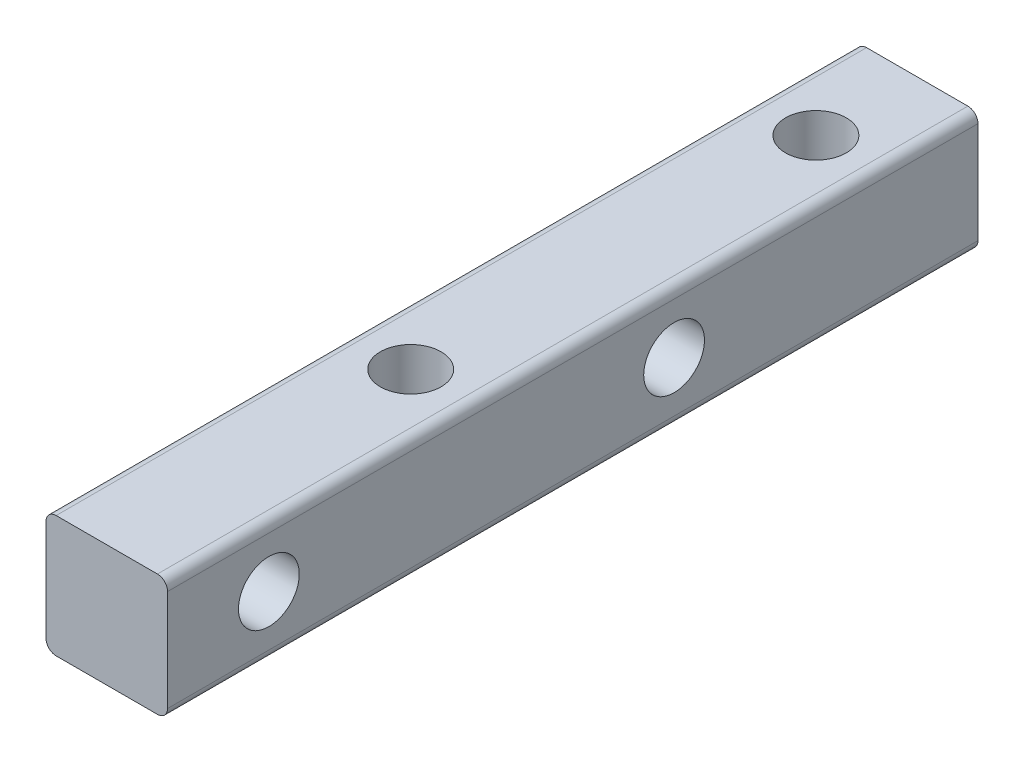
ISO-10303-21;
HEADER;
FILE_DESCRIPTION(('STEP AP214'),'2;1');
FILE_NAME('part.step','',(''),(''),'','','');
FILE_SCHEMA(('AUTOMOTIVE_DESIGN { 1 0 10303 214 1 1 1 1 }'));
ENDSEC;
DATA;
#1=APPLICATION_CONTEXT('core data for automotive mechanical design processes');
#2=APPLICATION_PROTOCOL_DEFINITION('international standard','automotive_design',2000,#1);
#3=PRODUCT_CONTEXT('',#1,'mechanical');
#4=PRODUCT('Part','Part','',(#3));
#5=PRODUCT_RELATED_PRODUCT_CATEGORY('part','',(#4));
#6=PRODUCT_DEFINITION_FORMATION('','',#4);
#7=PRODUCT_DEFINITION_CONTEXT('part definition',#1,'design');
#8=PRODUCT_DEFINITION('design','',#6,#7);
#9=PRODUCT_DEFINITION_SHAPE('','',#8);
#10=(LENGTH_UNIT() NAMED_UNIT(*) SI_UNIT(.MILLI.,.METRE.));
#11=(NAMED_UNIT(*) PLANE_ANGLE_UNIT() SI_UNIT($,.RADIAN.));
#12=(NAMED_UNIT(*) SI_UNIT($,.STERADIAN.) SOLID_ANGLE_UNIT());
#13=UNCERTAINTY_MEASURE_WITH_UNIT(LENGTH_MEASURE(1.E-05),#10,'distance_accuracy_value','');
#14=(GEOMETRIC_REPRESENTATION_CONTEXT(3) GLOBAL_UNCERTAINTY_ASSIGNED_CONTEXT((#13)) GLOBAL_UNIT_ASSIGNED_CONTEXT((#10,
#11,#12)) REPRESENTATION_CONTEXT('',''));
#15=CARTESIAN_POINT('',(0.,0.,0.));
#16=DIRECTION('',(0.,0.,1.));
#17=DIRECTION('',(1.,0.,0.));
#18=AXIS2_PLACEMENT_3D('',#15,#16,#17);
#19=CARTESIAN_POINT('',(0.,0.,40.));
#20=DIRECTION('',(1.,0.,0.));
#21=DIRECTION('',(0.,0.,-1.));
#22=AXIS2_PLACEMENT_3D('',#19,#20,#21);
#23=PLANE('',#22);
#24=CARTESIAN_POINT('',(0.,3.,35.));
#25=DIRECTION('',(-1.,0.,0.));
#26=DIRECTION('',(0.,0.,1.));
#27=AXIS2_PLACEMENT_3D('',#24,#25,#26);
#28=CIRCLE('',#27,1.5);
#29=CARTESIAN_POINT('',(0.,3.,36.5));
#30=VERTEX_POINT('',#29);
#31=EDGE_CURVE('E149',#30,#30,#28,.T.);
#32=ORIENTED_EDGE('',*,*,#31,.F.);
#33=EDGE_LOOP('',(#32));
#34=FACE_BOUND('',#33,.T.);
#35=CARTESIAN_POINT('',(0.,3.,15.));
#36=DIRECTION('',(-1.,0.,0.));
#37=DIRECTION('',(0.,0.,1.));
#38=AXIS2_PLACEMENT_3D('',#35,#36,#37);
#39=CIRCLE('',#38,1.5);
#40=CARTESIAN_POINT('',(0.,3.,16.5));
#41=VERTEX_POINT('',#40);
#42=EDGE_CURVE('E196',#41,#41,#39,.T.);
#43=ORIENTED_EDGE('',*,*,#42,.F.);
#44=EDGE_LOOP('',(#43));
#45=FACE_BOUND('',#44,.T.);
#46=DIRECTION('',(0.,-1.,0.));
#47=VECTOR('',#46,1.);
#48=CARTESIAN_POINT('',(0.,0.,0.));
#49=LINE('',#48,#47);
#50=CARTESIAN_POINT('',(0.,5.5,0.));
#51=VERTEX_POINT('',#50);
#52=CARTESIAN_POINT('',(0.,0.5,0.));
#53=VERTEX_POINT('',#52);
#54=EDGE_CURVE('E173',#51,#53,#49,.T.);
#55=ORIENTED_EDGE('',*,*,#54,.T.);
#56=DIRECTION('',(0.,0.,-1.));
#57=VECTOR('',#56,1.);
#58=CARTESIAN_POINT('',(0.,0.5,40.));
#59=LINE('',#58,#57);
#60=CARTESIAN_POINT('',(0.,0.5,40.));
#61=VERTEX_POINT('',#60);
#62=EDGE_CURVE('E11',#53,#61,#59,.F.);
#63=ORIENTED_EDGE('',*,*,#62,.T.);
#64=DIRECTION('',(0.,-1.,0.));
#65=VECTOR('',#64,1.);
#66=CARTESIAN_POINT('',(0.,0.,40.));
#67=LINE('',#66,#65);
#68=CARTESIAN_POINT('',(0.,5.5,40.));
#69=VERTEX_POINT('',#68);
#70=EDGE_CURVE('E132',#69,#61,#67,.T.);
#71=ORIENTED_EDGE('',*,*,#70,.F.);
#72=DIRECTION('',(0.,0.,-1.));
#73=VECTOR('',#72,1.);
#74=CARTESIAN_POINT('',(0.,5.5,40.));
#75=LINE('',#74,#73);
#76=EDGE_CURVE('E47',#69,#51,#75,.T.);
#77=ORIENTED_EDGE('',*,*,#76,.T.);
#78=EDGE_LOOP('',(#55,#63,#71,#77));
#79=FACE_BOUND('',#78,.T.);
#80=ADVANCED_FACE('F41',(#34,#45,#79),#23,.F.);
#81=CARTESIAN_POINT('',(0.,0.,40.));
#82=DIRECTION('',(0.,1.,0.));
#83=DIRECTION('',(0.,0.,1.));
#84=AXIS2_PLACEMENT_3D('',#81,#82,#83);
#85=PLANE('',#84);
#86=CARTESIAN_POINT('',(3.,0.,5.));
#87=DIRECTION('',(0.,1.,0.));
#88=DIRECTION('',(0.,0.,1.));
#89=AXIS2_PLACEMENT_3D('',#86,#87,#88);
#90=CIRCLE('',#89,1.5);
#91=CARTESIAN_POINT('',(3.,0.,6.5));
#92=VERTEX_POINT('',#91);
#93=EDGE_CURVE('E178',#92,#92,#90,.T.);
#94=ORIENTED_EDGE('',*,*,#93,.T.);
#95=EDGE_LOOP('',(#94));
#96=FACE_BOUND('',#95,.T.);
#97=CARTESIAN_POINT('',(3.,0.,25.));
#98=DIRECTION('',(0.,1.,0.));
#99=DIRECTION('',(0.,0.,1.));
#100=AXIS2_PLACEMENT_3D('',#97,#98,#99);
#101=CIRCLE('',#100,1.5);
#102=CARTESIAN_POINT('',(3.,0.,26.5));
#103=VERTEX_POINT('',#102);
#104=EDGE_CURVE('E181',#103,#103,#101,.T.);
#105=ORIENTED_EDGE('',*,*,#104,.T.);
#106=EDGE_LOOP('',(#105));
#107=FACE_BOUND('',#106,.T.);
#108=DIRECTION('',(1.,0.,0.));
#109=VECTOR('',#108,1.);
#110=CARTESIAN_POINT('',(0.,0.,0.));
#111=LINE('',#110,#109);
#112=CARTESIAN_POINT('',(0.5,0.,0.));
#113=VERTEX_POINT('',#112);
#114=CARTESIAN_POINT('',(5.5,0.,0.));
#115=VERTEX_POINT('',#114);
#116=EDGE_CURVE('E137',#113,#115,#111,.T.);
#117=ORIENTED_EDGE('',*,*,#116,.T.);
#118=DIRECTION('',(0.,0.,-1.));
#119=VECTOR('',#118,1.);
#120=CARTESIAN_POINT('',(5.5,0.,40.));
#121=LINE('',#120,#119);
#122=CARTESIAN_POINT('',(5.5,0.,40.));
#123=VERTEX_POINT('',#122);
#124=EDGE_CURVE('E57',#115,#123,#121,.F.);
#125=ORIENTED_EDGE('',*,*,#124,.T.);
#126=DIRECTION('',(1.,0.,0.));
#127=VECTOR('',#126,1.);
#128=CARTESIAN_POINT('',(0.,0.,40.));
#129=LINE('',#128,#127);
#130=CARTESIAN_POINT('',(0.5,0.,40.));
#131=VERTEX_POINT('',#130);
#132=EDGE_CURVE('E138',#131,#123,#129,.T.);
#133=ORIENTED_EDGE('',*,*,#132,.F.);
#134=DIRECTION('',(0.,0.,-1.));
#135=VECTOR('',#134,1.);
#136=CARTESIAN_POINT('',(0.5,0.,40.));
#137=LINE('',#136,#135);
#138=EDGE_CURVE('E164',#131,#113,#137,.T.);
#139=ORIENTED_EDGE('',*,*,#138,.T.);
#140=EDGE_LOOP('',(#117,#125,#133,#139));
#141=FACE_BOUND('',#140,.T.);
#142=ADVANCED_FACE('F210',(#96,#107,#141),#85,.F.);
#143=CARTESIAN_POINT('',(6.,0.,40.));
#144=DIRECTION('',(-1.,0.,0.));
#145=DIRECTION('',(0.,0.,1.));
#146=AXIS2_PLACEMENT_3D('',#143,#144,#145);
#147=PLANE('',#146);
#148=CARTESIAN_POINT('',(6.,3.,35.));
#149=DIRECTION('',(-1.,0.,0.));
#150=DIRECTION('',(0.,0.,1.));
#151=AXIS2_PLACEMENT_3D('',#148,#149,#150);
#152=CIRCLE('',#151,1.5);
#153=CARTESIAN_POINT('',(6.,3.,36.5));
#154=VERTEX_POINT('',#153);
#155=EDGE_CURVE('E143',#154,#154,#152,.T.);
#156=ORIENTED_EDGE('',*,*,#155,.T.);
#157=EDGE_LOOP('',(#156));
#158=FACE_BOUND('',#157,.T.);
#159=CARTESIAN_POINT('',(6.,3.,15.));
#160=DIRECTION('',(-1.,0.,0.));
#161=DIRECTION('',(0.,0.,1.));
#162=AXIS2_PLACEMENT_3D('',#159,#160,#161);
#163=CIRCLE('',#162,1.5);
#164=CARTESIAN_POINT('',(6.,3.,16.5));
#165=VERTEX_POINT('',#164);
#166=EDGE_CURVE('E145',#165,#165,#163,.T.);
#167=ORIENTED_EDGE('',*,*,#166,.T.);
#168=EDGE_LOOP('',(#167));
#169=FACE_BOUND('',#168,.T.);
#170=DIRECTION('',(0.,1.,0.));
#171=VECTOR('',#170,1.);
#172=CARTESIAN_POINT('',(6.,0.,0.));
#173=LINE('',#172,#171);
#174=CARTESIAN_POINT('',(6.,0.5,0.));
#175=VERTEX_POINT('',#174);
#176=CARTESIAN_POINT('',(6.,5.5,0.));
#177=VERTEX_POINT('',#176);
#178=EDGE_CURVE('E133',#175,#177,#173,.T.);
#179=ORIENTED_EDGE('',*,*,#178,.T.);
#180=DIRECTION('',(0.,0.,-1.));
#181=VECTOR('',#180,1.);
#182=CARTESIAN_POINT('',(6.,5.5,40.));
#183=LINE('',#182,#181);
#184=CARTESIAN_POINT('',(6.,5.5,40.));
#185=VERTEX_POINT('',#184);
#186=EDGE_CURVE('E115',#177,#185,#183,.F.);
#187=ORIENTED_EDGE('',*,*,#186,.T.);
#188=DIRECTION('',(0.,1.,0.));
#189=VECTOR('',#188,1.);
#190=CARTESIAN_POINT('',(6.,0.,40.));
#191=LINE('',#190,#189);
#192=CARTESIAN_POINT('',(6.,0.5,40.));
#193=VERTEX_POINT('',#192);
#194=EDGE_CURVE('E184',#193,#185,#191,.T.);
#195=ORIENTED_EDGE('',*,*,#194,.F.);
#196=DIRECTION('',(0.,0.,-1.));
#197=VECTOR('',#196,1.);
#198=CARTESIAN_POINT('',(6.,0.5,40.));
#199=LINE('',#198,#197);
#200=EDGE_CURVE('E120',#193,#175,#199,.T.);
#201=ORIENTED_EDGE('',*,*,#200,.T.);
#202=EDGE_LOOP('',(#179,#187,#195,#201));
#203=FACE_BOUND('',#202,.T.);
#204=ADVANCED_FACE('F217',(#158,#169,#203),#147,.F.);
#205=CARTESIAN_POINT('',(0.,6.,40.));
#206=DIRECTION('',(0.,-1.,0.));
#207=DIRECTION('',(0.,0.,-1.));
#208=AXIS2_PLACEMENT_3D('',#205,#206,#207);
#209=PLANE('',#208);
#210=CARTESIAN_POINT('',(3.,6.,5.));
#211=DIRECTION('',(0.,1.,0.));
#212=DIRECTION('',(0.,0.,1.));
#213=AXIS2_PLACEMENT_3D('',#210,#211,#212);
#214=CIRCLE('',#213,1.5);
#215=CARTESIAN_POINT('',(3.,6.,6.5));
#216=VERTEX_POINT('',#215);
#217=EDGE_CURVE('E194',#216,#216,#214,.T.);
#218=ORIENTED_EDGE('',*,*,#217,.F.);
#219=EDGE_LOOP('',(#218));
#220=FACE_BOUND('',#219,.T.);
#221=CARTESIAN_POINT('',(3.,6.,25.));
#222=DIRECTION('',(0.,1.,0.));
#223=DIRECTION('',(0.,0.,1.));
#224=AXIS2_PLACEMENT_3D('',#221,#222,#223);
#225=CIRCLE('',#224,1.5);
#226=CARTESIAN_POINT('',(3.,6.,26.5));
#227=VERTEX_POINT('',#226);
#228=EDGE_CURVE('E148',#227,#227,#225,.T.);
#229=ORIENTED_EDGE('',*,*,#228,.F.);
#230=EDGE_LOOP('',(#229));
#231=FACE_BOUND('',#230,.T.);
#232=DIRECTION('',(-1.,0.,0.));
#233=VECTOR('',#232,1.);
#234=CARTESIAN_POINT('',(0.,6.,40.));
#235=LINE('',#234,#233);
#236=CARTESIAN_POINT('',(5.5,6.,40.));
#237=VERTEX_POINT('',#236);
#238=CARTESIAN_POINT('',(0.5,6.,40.));
#239=VERTEX_POINT('',#238);
#240=EDGE_CURVE('E126',#237,#239,#235,.T.);
#241=ORIENTED_EDGE('',*,*,#240,.F.);
#242=DIRECTION('',(0.,0.,-1.));
#243=VECTOR('',#242,1.);
#244=CARTESIAN_POINT('',(5.5,6.,40.));
#245=LINE('',#244,#243);
#246=CARTESIAN_POINT('',(5.5,6.,0.));
#247=VERTEX_POINT('',#246);
#248=EDGE_CURVE('E111',#237,#247,#245,.T.);
#249=ORIENTED_EDGE('',*,*,#248,.T.);
#250=DIRECTION('',(-1.,0.,0.));
#251=VECTOR('',#250,1.);
#252=CARTESIAN_POINT('',(0.,6.,0.));
#253=LINE('',#252,#251);
#254=CARTESIAN_POINT('',(0.5,6.,0.));
#255=VERTEX_POINT('',#254);
#256=EDGE_CURVE('E121',#247,#255,#253,.T.);
#257=ORIENTED_EDGE('',*,*,#256,.T.);
#258=DIRECTION('',(0.,0.,-1.));
#259=VECTOR('',#258,1.);
#260=CARTESIAN_POINT('',(0.5,6.,40.));
#261=LINE('',#260,#259);
#262=EDGE_CURVE('E128',#255,#239,#261,.F.);
#263=ORIENTED_EDGE('',*,*,#262,.T.);
#264=EDGE_LOOP('',(#241,#249,#257,#263));
#265=FACE_BOUND('',#264,.T.);
#266=ADVANCED_FACE('F124',(#220,#231,#265),#209,.F.);
#267=CARTESIAN_POINT('',(0.,0.,40.));
#268=DIRECTION('',(0.,0.,-1.));
#269=DIRECTION('',(-1.,0.,0.));
#270=AXIS2_PLACEMENT_3D('',#267,#268,#269);
#271=PLANE('',#270);
#272=ORIENTED_EDGE('',*,*,#194,.T.);
#273=CARTESIAN_POINT('',(5.5,5.5,40.));
#274=DIRECTION('',(0.,0.,-1.));
#275=DIRECTION('',(-1.,0.,0.));
#276=AXIS2_PLACEMENT_3D('',#273,#274,#275);
#277=CIRCLE('',#276,0.5);
#278=EDGE_CURVE('E161',#185,#237,#277,.F.);
#279=ORIENTED_EDGE('',*,*,#278,.T.);
#280=ORIENTED_EDGE('',*,*,#240,.T.);
#281=CARTESIAN_POINT('',(0.5,5.5,40.));
#282=DIRECTION('',(0.,0.,-1.));
#283=DIRECTION('',(-1.,0.,0.));
#284=AXIS2_PLACEMENT_3D('',#281,#282,#283);
#285=CIRCLE('',#284,0.5);
#286=EDGE_CURVE('E157',#239,#69,#285,.F.);
#287=ORIENTED_EDGE('',*,*,#286,.T.);
#288=ORIENTED_EDGE('',*,*,#70,.T.);
#289=CARTESIAN_POINT('',(0.5,0.5,40.));
#290=DIRECTION('',(0.,0.,-1.));
#291=DIRECTION('',(-1.,0.,0.));
#292=AXIS2_PLACEMENT_3D('',#289,#290,#291);
#293=CIRCLE('',#292,0.5);
#294=EDGE_CURVE('E65',#61,#131,#293,.F.);
#295=ORIENTED_EDGE('',*,*,#294,.T.);
#296=ORIENTED_EDGE('',*,*,#132,.T.);
#297=CARTESIAN_POINT('',(5.5,0.5,40.));
#298=DIRECTION('',(0.,0.,-1.));
#299=DIRECTION('',(-1.,0.,0.));
#300=AXIS2_PLACEMENT_3D('',#297,#298,#299);
#301=CIRCLE('',#300,0.5);
#302=EDGE_CURVE('E163',#123,#193,#301,.F.);
#303=ORIENTED_EDGE('',*,*,#302,.T.);
#304=EDGE_LOOP('',(#272,#279,#280,#287,#288,#295,#296,#303));
#305=FACE_BOUND('',#304,.T.);
#306=ADVANCED_FACE('F230',(#305),#271,.F.);
#307=CARTESIAN_POINT('',(0.,0.,0.));
#308=DIRECTION('',(0.,0.,-1.));
#309=DIRECTION('',(-1.,0.,0.));
#310=AXIS2_PLACEMENT_3D('',#307,#308,#309);
#311=PLANE('',#310);
#312=ORIENTED_EDGE('',*,*,#256,.F.);
#313=CARTESIAN_POINT('',(5.5,5.5,0.));
#314=DIRECTION('',(0.,0.,-1.));
#315=DIRECTION('',(-1.,0.,0.));
#316=AXIS2_PLACEMENT_3D('',#313,#314,#315);
#317=CIRCLE('',#316,0.5);
#318=EDGE_CURVE('E110',#247,#177,#317,.T.);
#319=ORIENTED_EDGE('',*,*,#318,.T.);
#320=ORIENTED_EDGE('',*,*,#178,.F.);
#321=CARTESIAN_POINT('',(5.5,0.5,0.));
#322=DIRECTION('',(0.,0.,-1.));
#323=DIRECTION('',(-1.,0.,0.));
#324=AXIS2_PLACEMENT_3D('',#321,#322,#323);
#325=CIRCLE('',#324,0.5);
#326=EDGE_CURVE('E117',#175,#115,#325,.T.);
#327=ORIENTED_EDGE('',*,*,#326,.T.);
#328=ORIENTED_EDGE('',*,*,#116,.F.);
#329=CARTESIAN_POINT('',(0.5,0.5,0.));
#330=DIRECTION('',(0.,0.,-1.));
#331=DIRECTION('',(-1.,0.,0.));
#332=AXIS2_PLACEMENT_3D('',#329,#330,#331);
#333=CIRCLE('',#332,0.5);
#334=EDGE_CURVE('E155',#113,#53,#333,.T.);
#335=ORIENTED_EDGE('',*,*,#334,.T.);
#336=ORIENTED_EDGE('',*,*,#54,.F.);
#337=CARTESIAN_POINT('',(0.5,5.5,0.));
#338=DIRECTION('',(0.,0.,-1.));
#339=DIRECTION('',(-1.,0.,0.));
#340=AXIS2_PLACEMENT_3D('',#337,#338,#339);
#341=CIRCLE('',#340,0.5);
#342=EDGE_CURVE('E130',#51,#255,#341,.T.);
#343=ORIENTED_EDGE('',*,*,#342,.T.);
#344=EDGE_LOOP('',(#312,#319,#320,#327,#328,#335,#336,#343));
#345=FACE_BOUND('',#344,.T.);
#346=ADVANCED_FACE('F131',(#345),#311,.T.);
#347=CARTESIAN_POINT('',(3.,-44.,25.));
#348=DIRECTION('',(0.,1.,0.));
#349=DIRECTION('',(0.,0.,1.));
#350=AXIS2_PLACEMENT_3D('',#347,#348,#349);
#351=CYLINDRICAL_SURFACE('',#350,1.5);
#352=ORIENTED_EDGE('',*,*,#228,.T.);
#353=EDGE_LOOP('',(#352));
#354=FACE_BOUND('',#353,.T.);
#355=ORIENTED_EDGE('',*,*,#104,.F.);
#356=EDGE_LOOP('',(#355));
#357=FACE_BOUND('',#356,.T.);
#358=ADVANCED_FACE('F252',(#354,#357),#351,.F.);
#359=CARTESIAN_POINT('',(3.,-44.,5.));
#360=DIRECTION('',(0.,1.,0.));
#361=DIRECTION('',(0.,0.,1.));
#362=AXIS2_PLACEMENT_3D('',#359,#360,#361);
#363=CYLINDRICAL_SURFACE('',#362,1.5);
#364=ORIENTED_EDGE('',*,*,#217,.T.);
#365=EDGE_LOOP('',(#364));
#366=FACE_BOUND('',#365,.T.);
#367=ORIENTED_EDGE('',*,*,#93,.F.);
#368=EDGE_LOOP('',(#367));
#369=FACE_BOUND('',#368,.T.);
#370=ADVANCED_FACE('F213',(#366,#369),#363,.F.);
#371=CARTESIAN_POINT('',(50.,3.,15.));
#372=DIRECTION('',(-1.,0.,0.));
#373=DIRECTION('',(0.,0.,1.));
#374=AXIS2_PLACEMENT_3D('',#371,#372,#373);
#375=CYLINDRICAL_SURFACE('',#374,1.5);
#376=ORIENTED_EDGE('',*,*,#42,.T.);
#377=EDGE_LOOP('',(#376));
#378=FACE_BOUND('',#377,.T.);
#379=ORIENTED_EDGE('',*,*,#166,.F.);
#380=EDGE_LOOP('',(#379));
#381=FACE_BOUND('',#380,.T.);
#382=ADVANCED_FACE('F214',(#378,#381),#375,.F.);
#383=CARTESIAN_POINT('',(50.,3.,35.));
#384=DIRECTION('',(-1.,0.,0.));
#385=DIRECTION('',(0.,0.,1.));
#386=AXIS2_PLACEMENT_3D('',#383,#384,#385);
#387=CYLINDRICAL_SURFACE('',#386,1.5);
#388=ORIENTED_EDGE('',*,*,#31,.T.);
#389=EDGE_LOOP('',(#388));
#390=FACE_BOUND('',#389,.T.);
#391=ORIENTED_EDGE('',*,*,#155,.F.);
#392=EDGE_LOOP('',(#391));
#393=FACE_BOUND('',#392,.T.);
#394=ADVANCED_FACE('F204',(#390,#393),#387,.F.);
#395=CARTESIAN_POINT('',(5.5,5.5,40.));
#396=DIRECTION('',(0.,0.,-1.));
#397=DIRECTION('',(-1.,0.,0.));
#398=AXIS2_PLACEMENT_3D('',#395,#396,#397);
#399=CYLINDRICAL_SURFACE('',#398,0.5);
#400=ORIENTED_EDGE('',*,*,#278,.F.);
#401=ORIENTED_EDGE('',*,*,#186,.F.);
#402=ORIENTED_EDGE('',*,*,#318,.F.);
#403=ORIENTED_EDGE('',*,*,#248,.F.);
#404=EDGE_LOOP('',(#400,#401,#402,#403));
#405=FACE_BOUND('',#404,.T.);
#406=ADVANCED_FACE('F109',(#405),#399,.T.);
#407=CARTESIAN_POINT('',(5.5,0.5,40.));
#408=DIRECTION('',(0.,0.,-1.));
#409=DIRECTION('',(-1.,0.,0.));
#410=AXIS2_PLACEMENT_3D('',#407,#408,#409);
#411=CYLINDRICAL_SURFACE('',#410,0.5);
#412=ORIENTED_EDGE('',*,*,#302,.F.);
#413=ORIENTED_EDGE('',*,*,#124,.F.);
#414=ORIENTED_EDGE('',*,*,#326,.F.);
#415=ORIENTED_EDGE('',*,*,#200,.F.);
#416=EDGE_LOOP('',(#412,#413,#414,#415));
#417=FACE_BOUND('',#416,.T.);
#418=ADVANCED_FACE('F226',(#417),#411,.T.);
#419=CARTESIAN_POINT('',(0.5,0.5,40.));
#420=DIRECTION('',(0.,0.,-1.));
#421=DIRECTION('',(-1.,0.,0.));
#422=AXIS2_PLACEMENT_3D('',#419,#420,#421);
#423=CYLINDRICAL_SURFACE('',#422,0.5);
#424=ORIENTED_EDGE('',*,*,#294,.F.);
#425=ORIENTED_EDGE('',*,*,#62,.F.);
#426=ORIENTED_EDGE('',*,*,#334,.F.);
#427=ORIENTED_EDGE('',*,*,#138,.F.);
#428=EDGE_LOOP('',(#424,#425,#426,#427));
#429=FACE_BOUND('',#428,.T.);
#430=ADVANCED_FACE('F233',(#429),#423,.T.);
#431=CARTESIAN_POINT('',(0.5,5.5,40.));
#432=DIRECTION('',(0.,0.,-1.));
#433=DIRECTION('',(-1.,0.,0.));
#434=AXIS2_PLACEMENT_3D('',#431,#432,#433);
#435=CYLINDRICAL_SURFACE('',#434,0.5);
#436=ORIENTED_EDGE('',*,*,#286,.F.);
#437=ORIENTED_EDGE('',*,*,#262,.F.);
#438=ORIENTED_EDGE('',*,*,#342,.F.);
#439=ORIENTED_EDGE('',*,*,#76,.F.);
#440=EDGE_LOOP('',(#436,#437,#438,#439));
#441=FACE_BOUND('',#440,.T.);
#442=ADVANCED_FACE('F43',(#441),#435,.T.);
#443=CLOSED_SHELL('',(#80,#142,#204,#266,#306,#346,#358,#370,#382,#394,#406,#418,#430,#442));
#444=MANIFOLD_SOLID_BREP('B2',#443);
#445=ADVANCED_BREP_SHAPE_REPRESENTATION('',(#18,#444),#14);
#446=SHAPE_DEFINITION_REPRESENTATION(#9,#445);
ENDSEC;
END-ISO-10303-21;
